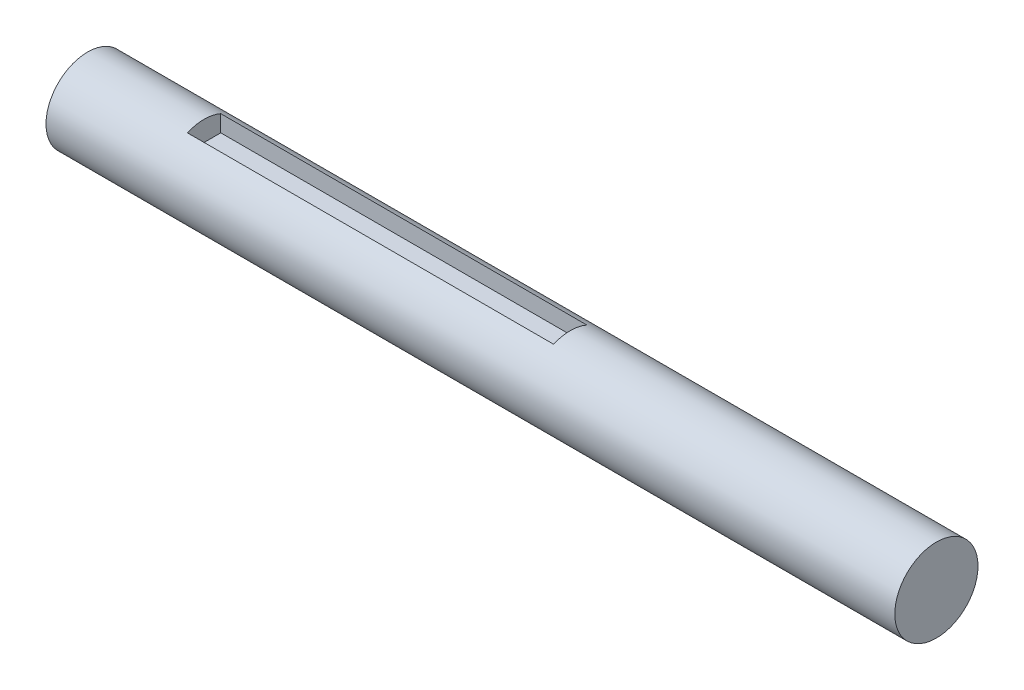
ISO-10303-21;
HEADER;
FILE_DESCRIPTION(('STEP AP214'),'2;1');
FILE_NAME('part.step','',(''),(''),'','','');
FILE_SCHEMA(('AUTOMOTIVE_DESIGN { 1 0 10303 214 1 1 1 1 }'));
ENDSEC;
DATA;
#1=APPLICATION_CONTEXT('core data for automotive mechanical design processes');
#2=APPLICATION_PROTOCOL_DEFINITION('international standard','automotive_design',2000,#1);
#3=PRODUCT_CONTEXT('',#1,'mechanical');
#4=PRODUCT('Part','Part','',(#3));
#5=PRODUCT_RELATED_PRODUCT_CATEGORY('part','',(#4));
#6=PRODUCT_DEFINITION_FORMATION('','',#4);
#7=PRODUCT_DEFINITION_CONTEXT('part definition',#1,'design');
#8=PRODUCT_DEFINITION('design','',#6,#7);
#9=PRODUCT_DEFINITION_SHAPE('','',#8);
#10=(LENGTH_UNIT() NAMED_UNIT(*) SI_UNIT(.MILLI.,.METRE.));
#11=(NAMED_UNIT(*) PLANE_ANGLE_UNIT() SI_UNIT($,.RADIAN.));
#12=(NAMED_UNIT(*) SI_UNIT($,.STERADIAN.) SOLID_ANGLE_UNIT());
#13=UNCERTAINTY_MEASURE_WITH_UNIT(LENGTH_MEASURE(1.E-05),#10,'distance_accuracy_value','');
#14=(GEOMETRIC_REPRESENTATION_CONTEXT(3) GLOBAL_UNCERTAINTY_ASSIGNED_CONTEXT((#13)) GLOBAL_UNIT_ASSIGNED_CONTEXT((#10,
#11,#12)) REPRESENTATION_CONTEXT('',''));
#15=CARTESIAN_POINT('',(0.,0.,0.));
#16=DIRECTION('',(0.,0.,1.));
#17=DIRECTION('',(1.,0.,0.));
#18=AXIS2_PLACEMENT_3D('',#15,#16,#17);
#19=CARTESIAN_POINT('',(-11.,0.,0.));
#20=DIRECTION('',(1.,0.,0.));
#21=DIRECTION('',(0.,0.,-1.));
#22=AXIS2_PLACEMENT_3D('',#19,#20,#21);
#23=CYLINDRICAL_SURFACE('',#22,2.5);
#24=DIRECTION('',(1.,0.,0.));
#25=VECTOR('',#24,1.);
#26=CARTESIAN_POINT('',(-11.,2.29128784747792,-1.));
#27=LINE('',#26,#25);
#28=CARTESIAN_POINT('',(11.,2.29128784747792,-1.));
#29=VERTEX_POINT('',#28);
#30=CARTESIAN_POINT('',(-11.,2.29128784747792,-1.));
#31=VERTEX_POINT('',#30);
#32=EDGE_CURVE('E42',#29,#31,#27,.F.);
#33=ORIENTED_EDGE('',*,*,#32,.F.);
#34=CARTESIAN_POINT('',(11.,0.,0.));
#35=DIRECTION('',(1.,0.,0.));
#36=DIRECTION('',(0.,0.,-1.));
#37=AXIS2_PLACEMENT_3D('',#34,#35,#36);
#38=CIRCLE('',#37,2.5);
#39=CARTESIAN_POINT('',(11.,2.29128784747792,1.));
#40=VERTEX_POINT('',#39);
#41=EDGE_CURVE('E114',#29,#40,#38,.T.);
#42=ORIENTED_EDGE('',*,*,#41,.T.);
#43=DIRECTION('',(1.,0.,0.));
#44=VECTOR('',#43,1.);
#45=CARTESIAN_POINT('',(-11.,2.29128784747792,1.));
#46=LINE('',#45,#44);
#47=CARTESIAN_POINT('',(-11.,2.29128784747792,1.));
#48=VERTEX_POINT('',#47);
#49=EDGE_CURVE('E101',#48,#40,#46,.T.);
#50=ORIENTED_EDGE('',*,*,#49,.F.);
#51=CARTESIAN_POINT('',(-11.,0.,0.));
#52=DIRECTION('',(-1.,0.,0.));
#53=DIRECTION('',(0.,0.,1.));
#54=AXIS2_PLACEMENT_3D('',#51,#52,#53);
#55=CIRCLE('',#54,2.5);
#56=EDGE_CURVE('E92',#48,#31,#55,.T.);
#57=ORIENTED_EDGE('',*,*,#56,.T.);
#58=EDGE_LOOP('',(#33,#42,#50,#57));
#59=FACE_BOUND('',#58,.T.);
#60=CARTESIAN_POINT('',(33.,0.,0.));
#61=DIRECTION('',(1.,0.,0.));
#62=DIRECTION('',(0.,0.,-1.));
#63=AXIS2_PLACEMENT_3D('',#60,#61,#62);
#64=CIRCLE('',#63,2.5);
#65=CARTESIAN_POINT('',(33.,0.,-2.5));
#66=VERTEX_POINT('',#65);
#67=EDGE_CURVE('E116',#66,#66,#64,.T.);
#68=ORIENTED_EDGE('',*,*,#67,.F.);
#69=EDGE_LOOP('',(#68));
#70=FACE_BOUND('',#69,.T.);
#71=CARTESIAN_POINT('',(-18.,0.,0.));
#72=DIRECTION('',(-1.,0.,0.));
#73=DIRECTION('',(0.,0.,1.));
#74=AXIS2_PLACEMENT_3D('',#71,#72,#73);
#75=CIRCLE('',#74,2.5);
#76=CARTESIAN_POINT('',(-18.,0.,2.5));
#77=VERTEX_POINT('',#76);
#78=EDGE_CURVE('E117',#77,#77,#75,.T.);
#79=ORIENTED_EDGE('',*,*,#78,.F.);
#80=EDGE_LOOP('',(#79));
#81=FACE_BOUND('',#80,.T.);
#82=ADVANCED_FACE('F33',(#59,#70,#81),#23,.T.);
#83=CARTESIAN_POINT('',(-11.,2.79128784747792,-1.));
#84=DIRECTION('',(0.,0.,-1.));
#85=DIRECTION('',(-1.,0.,0.));
#86=AXIS2_PLACEMENT_3D('',#83,#84,#85);
#87=PLANE('',#86);
#88=ORIENTED_EDGE('',*,*,#32,.T.);
#89=DIRECTION('',(0.,1.,0.));
#90=VECTOR('',#89,1.);
#91=CARTESIAN_POINT('',(-11.,1.29128784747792,-1.));
#92=LINE('',#91,#90);
#93=CARTESIAN_POINT('',(-11.,1.29128784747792,-1.));
#94=VERTEX_POINT('',#93);
#95=EDGE_CURVE('E36',#94,#31,#92,.T.);
#96=ORIENTED_EDGE('',*,*,#95,.F.);
#97=DIRECTION('',(1.,0.,0.));
#98=VECTOR('',#97,1.);
#99=CARTESIAN_POINT('',(-11.,1.29128784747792,-1.));
#100=LINE('',#99,#98);
#101=CARTESIAN_POINT('',(11.,1.29128784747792,-1.));
#102=VERTEX_POINT('',#101);
#103=EDGE_CURVE('E84',#94,#102,#100,.T.);
#104=ORIENTED_EDGE('',*,*,#103,.T.);
#105=DIRECTION('',(0.,1.,0.));
#106=VECTOR('',#105,1.);
#107=CARTESIAN_POINT('',(11.,2.79128784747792,-1.));
#108=LINE('',#107,#106);
#109=EDGE_CURVE('E93',#102,#29,#108,.T.);
#110=ORIENTED_EDGE('',*,*,#109,.T.);
#111=EDGE_LOOP('',(#88,#96,#104,#110));
#112=FACE_BOUND('',#111,.T.);
#113=ADVANCED_FACE('F134',(#112),#87,.F.);
#114=CARTESIAN_POINT('',(-11.,1.29128784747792,1.));
#115=DIRECTION('',(0.,-1.,0.));
#116=DIRECTION('',(0.,0.,-1.));
#117=AXIS2_PLACEMENT_3D('',#114,#115,#116);
#118=PLANE('',#117);
#119=DIRECTION('',(0.,0.,-1.));
#120=VECTOR('',#119,1.);
#121=CARTESIAN_POINT('',(11.,1.29128784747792,1.));
#122=LINE('',#121,#120);
#123=CARTESIAN_POINT('',(11.,1.29128784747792,1.));
#124=VERTEX_POINT('',#123);
#125=EDGE_CURVE('E95',#124,#102,#122,.T.);
#126=ORIENTED_EDGE('',*,*,#125,.T.);
#127=ORIENTED_EDGE('',*,*,#103,.F.);
#128=DIRECTION('',(0.,0.,-1.));
#129=VECTOR('',#128,1.);
#130=CARTESIAN_POINT('',(-11.,1.29128784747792,1.));
#131=LINE('',#130,#129);
#132=CARTESIAN_POINT('',(-11.,1.29128784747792,1.));
#133=VERTEX_POINT('',#132);
#134=EDGE_CURVE('E79',#133,#94,#131,.T.);
#135=ORIENTED_EDGE('',*,*,#134,.F.);
#136=DIRECTION('',(1.,0.,0.));
#137=VECTOR('',#136,1.);
#138=CARTESIAN_POINT('',(-11.,1.29128784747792,1.));
#139=LINE('',#138,#137);
#140=EDGE_CURVE('E82',#133,#124,#139,.T.);
#141=ORIENTED_EDGE('',*,*,#140,.T.);
#142=EDGE_LOOP('',(#126,#127,#135,#141));
#143=FACE_BOUND('',#142,.T.);
#144=ADVANCED_FACE('F81',(#143),#118,.F.);
#145=CARTESIAN_POINT('',(-11.,2.29128784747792,1.));
#146=DIRECTION('',(0.,0.,1.));
#147=DIRECTION('',(1.,0.,0.));
#148=AXIS2_PLACEMENT_3D('',#145,#146,#147);
#149=PLANE('',#148);
#150=ORIENTED_EDGE('',*,*,#49,.T.);
#151=DIRECTION('',(0.,-1.,0.));
#152=VECTOR('',#151,1.);
#153=CARTESIAN_POINT('',(11.,0.,1.));
#154=LINE('',#153,#152);
#155=EDGE_CURVE('E11',#40,#124,#154,.T.);
#156=ORIENTED_EDGE('',*,*,#155,.T.);
#157=ORIENTED_EDGE('',*,*,#140,.F.);
#158=DIRECTION('',(0.,-1.,0.));
#159=VECTOR('',#158,1.);
#160=CARTESIAN_POINT('',(-11.,2.29128784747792,1.));
#161=LINE('',#160,#159);
#162=EDGE_CURVE('E57',#48,#133,#161,.T.);
#163=ORIENTED_EDGE('',*,*,#162,.F.);
#164=EDGE_LOOP('',(#150,#156,#157,#163));
#165=FACE_BOUND('',#164,.T.);
#166=ADVANCED_FACE('F87',(#165),#149,.F.);
#167=CARTESIAN_POINT('',(33.,0.,0.));
#168=DIRECTION('',(1.,0.,0.));
#169=DIRECTION('',(0.,0.,-1.));
#170=AXIS2_PLACEMENT_3D('',#167,#168,#169);
#171=PLANE('',#170);
#172=ORIENTED_EDGE('',*,*,#67,.T.);
#173=EDGE_LOOP('',(#172));
#174=FACE_BOUND('',#173,.T.);
#175=ADVANCED_FACE('F147',(#174),#171,.T.);
#176=CARTESIAN_POINT('',(11.,0.,0.));
#177=DIRECTION('',(1.,0.,0.));
#178=DIRECTION('',(0.,0.,-1.));
#179=AXIS2_PLACEMENT_3D('',#176,#177,#178);
#180=PLANE('',#179);
#181=ORIENTED_EDGE('',*,*,#109,.F.);
#182=ORIENTED_EDGE('',*,*,#125,.F.);
#183=ORIENTED_EDGE('',*,*,#155,.F.);
#184=ORIENTED_EDGE('',*,*,#41,.F.);
#185=EDGE_LOOP('',(#181,#182,#183,#184));
#186=FACE_BOUND('',#185,.T.);
#187=ADVANCED_FACE('F144',(#186),#180,.F.);
#188=CARTESIAN_POINT('',(-11.,0.,0.));
#189=DIRECTION('',(-1.,0.,0.));
#190=DIRECTION('',(0.,0.,1.));
#191=AXIS2_PLACEMENT_3D('',#188,#189,#190);
#192=PLANE('',#191);
#193=ORIENTED_EDGE('',*,*,#134,.T.);
#194=ORIENTED_EDGE('',*,*,#95,.T.);
#195=ORIENTED_EDGE('',*,*,#56,.F.);
#196=ORIENTED_EDGE('',*,*,#162,.T.);
#197=EDGE_LOOP('',(#193,#194,#195,#196));
#198=FACE_BOUND('',#197,.T.);
#199=ADVANCED_FACE('F90',(#198),#192,.F.);
#200=CARTESIAN_POINT('',(-18.,0.,0.));
#201=DIRECTION('',(-1.,0.,0.));
#202=DIRECTION('',(0.,0.,1.));
#203=AXIS2_PLACEMENT_3D('',#200,#201,#202);
#204=PLANE('',#203);
#205=ORIENTED_EDGE('',*,*,#78,.T.);
#206=EDGE_LOOP('',(#205));
#207=FACE_BOUND('',#206,.T.);
#208=ADVANCED_FACE('F131',(#207),#204,.T.);
#209=CLOSED_SHELL('',(#82,#113,#144,#166,#175,#187,#199,#208));
#210=MANIFOLD_SOLID_BREP('B2',#209);
#211=ADVANCED_BREP_SHAPE_REPRESENTATION('',(#18,#210),#14);
#212=SHAPE_DEFINITION_REPRESENTATION(#9,#211);
ENDSEC;
END-ISO-10303-21;
